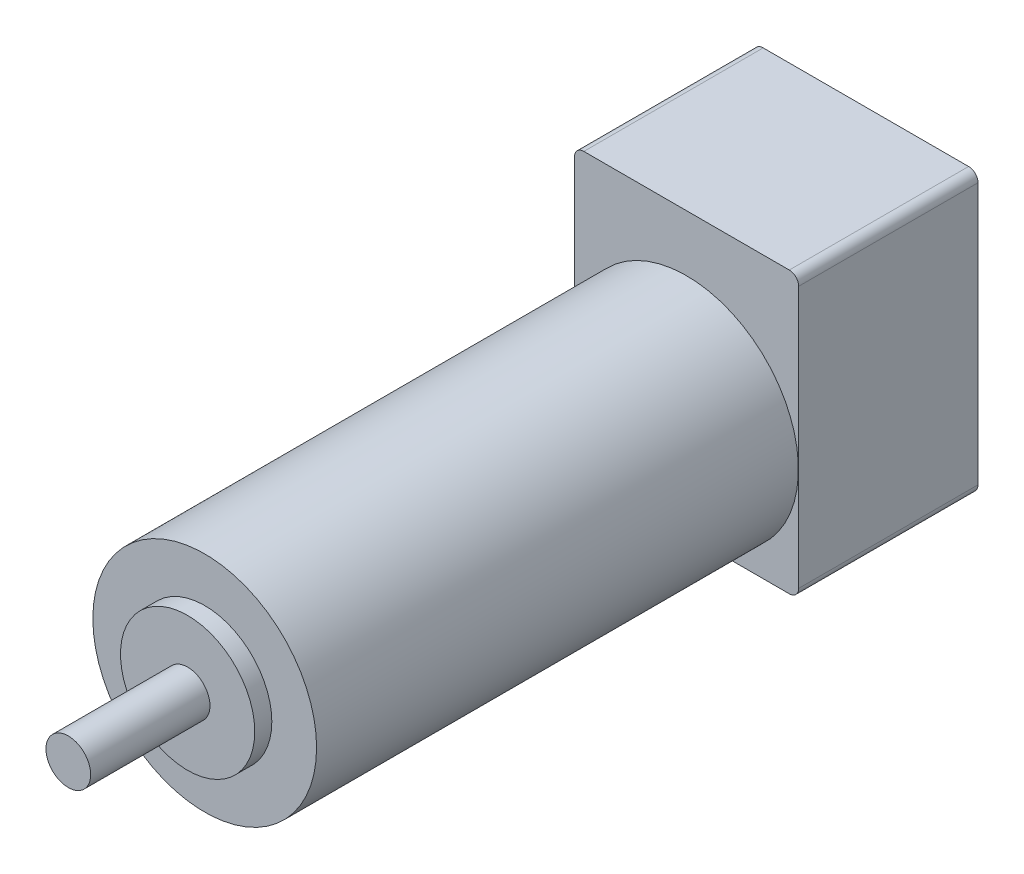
ISO-10303-21;
HEADER;
FILE_DESCRIPTION(('STEP AP214'),'2;1');
FILE_NAME('part.step','',(''),(''),'','','');
FILE_SCHEMA(('AUTOMOTIVE_DESIGN { 1 0 10303 214 1 1 1 1 }'));
ENDSEC;
DATA;
#1=APPLICATION_CONTEXT('core data for automotive mechanical design processes');
#2=APPLICATION_PROTOCOL_DEFINITION('international standard','automotive_design',2000,#1);
#3=PRODUCT_CONTEXT('',#1,'mechanical');
#4=PRODUCT('Part','Part','',(#3));
#5=PRODUCT_RELATED_PRODUCT_CATEGORY('part','',(#4));
#6=PRODUCT_DEFINITION_FORMATION('','',#4);
#7=PRODUCT_DEFINITION_CONTEXT('part definition',#1,'design');
#8=PRODUCT_DEFINITION('design','',#6,#7);
#9=PRODUCT_DEFINITION_SHAPE('','',#8);
#10=(LENGTH_UNIT() NAMED_UNIT(*) SI_UNIT(.MILLI.,.METRE.));
#11=(NAMED_UNIT(*) PLANE_ANGLE_UNIT() SI_UNIT($,.RADIAN.));
#12=(NAMED_UNIT(*) SI_UNIT($,.STERADIAN.) SOLID_ANGLE_UNIT());
#13=UNCERTAINTY_MEASURE_WITH_UNIT(LENGTH_MEASURE(1.E-05),#10,'distance_accuracy_value','');
#14=(GEOMETRIC_REPRESENTATION_CONTEXT(3) GLOBAL_UNCERTAINTY_ASSIGNED_CONTEXT((#13)) GLOBAL_UNIT_ASSIGNED_CONTEXT((#10,
#11,#12)) REPRESENTATION_CONTEXT('',''));
#15=CARTESIAN_POINT('',(0.,0.,0.));
#16=DIRECTION('',(0.,0.,1.));
#17=DIRECTION('',(1.,0.,0.));
#18=AXIS2_PLACEMENT_3D('',#15,#16,#17);
#19=CARTESIAN_POINT('',(-27.7622,-27.813,-48.4886));
#20=DIRECTION('',(0.,0.,1.));
#21=DIRECTION('',(1.,0.,0.));
#22=AXIS2_PLACEMENT_3D('',#19,#20,#21);
#23=CYLINDRICAL_SURFACE('',#22,2.54);
#24=DIRECTION('',(0.,0.,1.));
#25=VECTOR('',#24,1.);
#26=CARTESIAN_POINT('',(-30.3022,-27.813,-48.4886));
#27=LINE('',#26,#25);
#28=CARTESIAN_POINT('',(-30.3022,-27.813,-48.4886));
#29=VERTEX_POINT('',#28);
#30=CARTESIAN_POINT('',(-30.3022,-27.813,0.));
#31=VERTEX_POINT('',#30);
#32=EDGE_CURVE('E162',#29,#31,#27,.T.);
#33=ORIENTED_EDGE('',*,*,#32,.F.);
#34=CARTESIAN_POINT('',(-27.7622,-27.813,-48.4886));
#35=DIRECTION('',(0.,0.,-1.));
#36=DIRECTION('',(-1.,0.,0.));
#37=AXIS2_PLACEMENT_3D('',#34,#35,#36);
#38=CIRCLE('',#37,2.54);
#39=CARTESIAN_POINT('',(-27.7622,-30.353,-48.4886));
#40=VERTEX_POINT('',#39);
#41=EDGE_CURVE('E43',#40,#29,#38,.T.);
#42=ORIENTED_EDGE('',*,*,#41,.F.);
#43=DIRECTION('',(0.,0.,1.));
#44=VECTOR('',#43,1.);
#45=CARTESIAN_POINT('',(-27.7622,-30.353,-48.4886));
#46=LINE('',#45,#44);
#47=CARTESIAN_POINT('',(-27.7622,-30.353,0.));
#48=VERTEX_POINT('',#47);
#49=EDGE_CURVE('E165',#48,#40,#46,.F.);
#50=ORIENTED_EDGE('',*,*,#49,.F.);
#51=CARTESIAN_POINT('',(-27.7622,-27.813,0.));
#52=DIRECTION('',(0.,0.,-1.));
#53=DIRECTION('',(-1.,0.,0.));
#54=AXIS2_PLACEMENT_3D('',#51,#52,#53);
#55=CIRCLE('',#54,2.54);
#56=EDGE_CURVE('E11',#31,#48,#55,.F.);
#57=ORIENTED_EDGE('',*,*,#56,.F.);
#58=EDGE_LOOP('',(#33,#42,#50,#57));
#59=FACE_BOUND('',#58,.T.);
#60=ADVANCED_FACE('F36',(#59),#23,.T.);
#61=CARTESIAN_POINT('',(-27.7622,42.926,-48.4886));
#62=DIRECTION('',(0.,0.,1.));
#63=DIRECTION('',(1.,0.,0.));
#64=AXIS2_PLACEMENT_3D('',#61,#62,#63);
#65=CYLINDRICAL_SURFACE('',#64,2.54);
#66=DIRECTION('',(0.,0.,1.));
#67=VECTOR('',#66,1.);
#68=CARTESIAN_POINT('',(-27.7622,45.466,-48.4886));
#69=LINE('',#68,#67);
#70=CARTESIAN_POINT('',(-27.7622,45.466,-48.4886));
#71=VERTEX_POINT('',#70);
#72=CARTESIAN_POINT('',(-27.7622,45.466,0.));
#73=VERTEX_POINT('',#72);
#74=EDGE_CURVE('E151',#71,#73,#69,.T.);
#75=ORIENTED_EDGE('',*,*,#74,.F.);
#76=CARTESIAN_POINT('',(-27.7622,42.926,-48.4886));
#77=DIRECTION('',(0.,0.,-1.));
#78=DIRECTION('',(-1.,0.,0.));
#79=AXIS2_PLACEMENT_3D('',#76,#77,#78);
#80=CIRCLE('',#79,2.54);
#81=CARTESIAN_POINT('',(-30.3022,42.926,-48.4886));
#82=VERTEX_POINT('',#81);
#83=EDGE_CURVE('E157',#82,#71,#80,.T.);
#84=ORIENTED_EDGE('',*,*,#83,.F.);
#85=DIRECTION('',(0.,0.,1.));
#86=VECTOR('',#85,1.);
#87=CARTESIAN_POINT('',(-30.3022,42.926,-48.4886));
#88=LINE('',#87,#86);
#89=CARTESIAN_POINT('',(-30.3022,42.926,0.));
#90=VERTEX_POINT('',#89);
#91=EDGE_CURVE('E154',#90,#82,#88,.F.);
#92=ORIENTED_EDGE('',*,*,#91,.F.);
#93=CARTESIAN_POINT('',(-27.7622,42.926,0.));
#94=DIRECTION('',(0.,0.,-1.));
#95=DIRECTION('',(-1.,0.,0.));
#96=AXIS2_PLACEMENT_3D('',#93,#94,#95);
#97=CIRCLE('',#96,2.54);
#98=EDGE_CURVE('E159',#73,#90,#97,.F.);
#99=ORIENTED_EDGE('',*,*,#98,.F.);
#100=EDGE_LOOP('',(#75,#84,#92,#99));
#101=FACE_BOUND('',#100,.T.);
#102=ADVANCED_FACE('F176',(#101),#65,.T.);
#103=CARTESIAN_POINT('',(27.7876,42.926,-48.4886));
#104=DIRECTION('',(0.,0.,-1.));
#105=DIRECTION('',(-1.,0.,0.));
#106=AXIS2_PLACEMENT_3D('',#103,#104,#105);
#107=CYLINDRICAL_SURFACE('',#106,2.54);
#108=DIRECTION('',(0.,0.,-1.));
#109=VECTOR('',#108,1.);
#110=CARTESIAN_POINT('',(27.7876,45.466,-48.4886));
#111=LINE('',#110,#109);
#112=CARTESIAN_POINT('',(27.7876,45.466,0.));
#113=VERTEX_POINT('',#112);
#114=CARTESIAN_POINT('',(27.7876,45.466,-48.4886));
#115=VERTEX_POINT('',#114);
#116=EDGE_CURVE('E108',#113,#115,#111,.T.);
#117=ORIENTED_EDGE('',*,*,#116,.F.);
#118=CARTESIAN_POINT('',(27.7876,42.926,0.));
#119=DIRECTION('',(0.,0.,-1.));
#120=DIRECTION('',(-1.,0.,0.));
#121=AXIS2_PLACEMENT_3D('',#118,#119,#120);
#122=CIRCLE('',#121,2.54);
#123=CARTESIAN_POINT('',(30.3276,42.926,0.));
#124=VERTEX_POINT('',#123);
#125=EDGE_CURVE('E146',#124,#113,#122,.F.);
#126=ORIENTED_EDGE('',*,*,#125,.F.);
#127=DIRECTION('',(0.,0.,-1.));
#128=VECTOR('',#127,1.);
#129=CARTESIAN_POINT('',(30.3276,42.926,-48.4886));
#130=LINE('',#129,#128);
#131=CARTESIAN_POINT('',(30.3276,42.926,-48.4886));
#132=VERTEX_POINT('',#131);
#133=EDGE_CURVE('E143',#132,#124,#130,.F.);
#134=ORIENTED_EDGE('',*,*,#133,.F.);
#135=CARTESIAN_POINT('',(27.7876,42.926,-48.4886));
#136=DIRECTION('',(0.,0.,-1.));
#137=DIRECTION('',(-1.,0.,0.));
#138=AXIS2_PLACEMENT_3D('',#135,#136,#137);
#139=CIRCLE('',#138,2.54);
#140=EDGE_CURVE('E149',#115,#132,#139,.T.);
#141=ORIENTED_EDGE('',*,*,#140,.F.);
#142=EDGE_LOOP('',(#117,#126,#134,#141));
#143=FACE_BOUND('',#142,.T.);
#144=ADVANCED_FACE('F183',(#143),#107,.T.);
#145=CARTESIAN_POINT('',(27.7876,-27.813,-48.4886));
#146=DIRECTION('',(0.,0.,1.));
#147=DIRECTION('',(1.,0.,0.));
#148=AXIS2_PLACEMENT_3D('',#145,#146,#147);
#149=CYLINDRICAL_SURFACE('',#148,2.54);
#150=DIRECTION('',(0.,0.,1.));
#151=VECTOR('',#150,1.);
#152=CARTESIAN_POINT('',(27.7876,-30.353,-48.4886));
#153=LINE('',#152,#151);
#154=CARTESIAN_POINT('',(27.7876,-30.353,-48.4886));
#155=VERTEX_POINT('',#154);
#156=CARTESIAN_POINT('',(27.7876,-30.353,0.));
#157=VERTEX_POINT('',#156);
#158=EDGE_CURVE('E103',#155,#157,#153,.T.);
#159=ORIENTED_EDGE('',*,*,#158,.F.);
#160=CARTESIAN_POINT('',(27.7876,-27.813,-48.4886));
#161=DIRECTION('',(0.,0.,-1.));
#162=DIRECTION('',(-1.,0.,0.));
#163=AXIS2_PLACEMENT_3D('',#160,#161,#162);
#164=CIRCLE('',#163,2.54);
#165=CARTESIAN_POINT('',(30.3276,-27.813,-48.4886));
#166=VERTEX_POINT('',#165);
#167=EDGE_CURVE('E109',#166,#155,#164,.T.);
#168=ORIENTED_EDGE('',*,*,#167,.F.);
#169=DIRECTION('',(0.,0.,1.));
#170=VECTOR('',#169,1.);
#171=CARTESIAN_POINT('',(30.3276,-27.813,-48.4886));
#172=LINE('',#171,#170);
#173=CARTESIAN_POINT('',(30.3276,-27.813,0.));
#174=VERTEX_POINT('',#173);
#175=EDGE_CURVE('E106',#174,#166,#172,.F.);
#176=ORIENTED_EDGE('',*,*,#175,.F.);
#177=CARTESIAN_POINT('',(27.7876,-27.813,0.));
#178=DIRECTION('',(0.,0.,-1.));
#179=DIRECTION('',(-1.,0.,0.));
#180=AXIS2_PLACEMENT_3D('',#177,#178,#179);
#181=CIRCLE('',#180,2.54);
#182=EDGE_CURVE('E99',#157,#174,#181,.F.);
#183=ORIENTED_EDGE('',*,*,#182,.F.);
#184=EDGE_LOOP('',(#159,#168,#176,#183));
#185=FACE_BOUND('',#184,.T.);
#186=ADVANCED_FACE('F101',(#185),#149,.T.);
#187=CARTESIAN_POINT('',(0.,0.,134.8994));
#188=DIRECTION('',(0.,0.,1.));
#189=DIRECTION('',(1.,0.,0.));
#190=AXIS2_PLACEMENT_3D('',#187,#188,#189);
#191=PLANE('',#190);
#192=CARTESIAN_POINT('',(0.,0.,134.8994));
#193=DIRECTION('',(0.,0.,1.));
#194=DIRECTION('',(1.,0.,0.));
#195=AXIS2_PLACEMENT_3D('',#192,#193,#194);
#196=CIRCLE('',#195,18.1483);
#197=CARTESIAN_POINT('',(18.1483,0.,134.8994));
#198=VERTEX_POINT('',#197);
#199=EDGE_CURVE('E243',#198,#198,#196,.T.);
#200=ORIENTED_EDGE('',*,*,#199,.T.);
#201=EDGE_LOOP('',(#200));
#202=FACE_BOUND('',#201,.T.);
#203=CARTESIAN_POINT('',(0.,0.,134.8994));
#204=DIRECTION('',(0.,0.,1.));
#205=DIRECTION('',(1.,0.,0.));
#206=AXIS2_PLACEMENT_3D('',#203,#204,#205);
#207=CIRCLE('',#206,6.0452);
#208=CARTESIAN_POINT('',(6.0452,0.,134.8994));
#209=VERTEX_POINT('',#208);
#210=EDGE_CURVE('E252',#209,#209,#207,.T.);
#211=ORIENTED_EDGE('',*,*,#210,.F.);
#212=EDGE_LOOP('',(#211));
#213=FACE_BOUND('',#212,.T.);
#214=ADVANCED_FACE('F208',(#202,#213),#191,.T.);
#215=CARTESIAN_POINT('',(0.,0.,130.2766));
#216=DIRECTION('',(0.,0.,1.));
#217=DIRECTION('',(1.,0.,0.));
#218=AXIS2_PLACEMENT_3D('',#215,#216,#217);
#219=PLANE('',#218);
#220=CARTESIAN_POINT('',(0.,0.,130.2766));
#221=DIRECTION('',(0.,0.,1.));
#222=DIRECTION('',(1.,0.,0.));
#223=AXIS2_PLACEMENT_3D('',#220,#221,#222);
#224=CIRCLE('',#223,30.2514);
#225=CARTESIAN_POINT('',(30.2514,0.,130.2766));
#226=VERTEX_POINT('',#225);
#227=EDGE_CURVE('E117',#226,#226,#224,.T.);
#228=ORIENTED_EDGE('',*,*,#227,.T.);
#229=EDGE_LOOP('',(#228));
#230=FACE_BOUND('',#229,.T.);
#231=CARTESIAN_POINT('',(0.,0.,130.2766));
#232=DIRECTION('',(0.,0.,1.));
#233=DIRECTION('',(1.,0.,0.));
#234=AXIS2_PLACEMENT_3D('',#231,#232,#233);
#235=CIRCLE('',#234,18.1483);
#236=CARTESIAN_POINT('',(18.1483,0.,130.2766));
#237=VERTEX_POINT('',#236);
#238=EDGE_CURVE('E246',#237,#237,#235,.T.);
#239=ORIENTED_EDGE('',*,*,#238,.F.);
#240=EDGE_LOOP('',(#239));
#241=FACE_BOUND('',#240,.T.);
#242=ADVANCED_FACE('F212',(#230,#241),#219,.T.);
#243=CARTESIAN_POINT('',(0.,0.,130.2766));
#244=DIRECTION('',(0.,0.,-1.));
#245=DIRECTION('',(-1.,0.,0.));
#246=AXIS2_PLACEMENT_3D('',#243,#244,#245);
#247=CYLINDRICAL_SURFACE('',#246,30.2514);
#248=ORIENTED_EDGE('',*,*,#227,.F.);
#249=EDGE_LOOP('',(#248));
#250=FACE_BOUND('',#249,.T.);
#251=CARTESIAN_POINT('',(0.,0.,0.));
#252=DIRECTION('',(0.,0.,-1.));
#253=DIRECTION('',(-1.,0.,0.));
#254=AXIS2_PLACEMENT_3D('',#251,#252,#253);
#255=CIRCLE('',#254,30.2514);
#256=CARTESIAN_POINT('',(-30.2514,0.,0.));
#257=VERTEX_POINT('',#256);
#258=EDGE_CURVE('E134',#257,#257,#255,.T.);
#259=ORIENTED_EDGE('',*,*,#258,.F.);
#260=EDGE_LOOP('',(#259));
#261=FACE_BOUND('',#260,.T.);
#262=ADVANCED_FACE('F209',(#250,#261),#247,.T.);
#263=CARTESIAN_POINT('',(-30.3022,45.466,0.));
#264=DIRECTION('',(0.,0.,-1.));
#265=DIRECTION('',(-1.,0.,0.));
#266=AXIS2_PLACEMENT_3D('',#263,#264,#265);
#267=PLANE('',#266);
#268=DIRECTION('',(0.,1.,0.));
#269=VECTOR('',#268,1.);
#270=CARTESIAN_POINT('',(-30.3022,-30.353,0.));
#271=LINE('',#270,#269);
#272=EDGE_CURVE('E173',#31,#90,#271,.T.);
#273=ORIENTED_EDGE('',*,*,#272,.F.);
#274=ORIENTED_EDGE('',*,*,#56,.T.);
#275=DIRECTION('',(-1.,0.,0.));
#276=VECTOR('',#275,1.);
#277=CARTESIAN_POINT('',(-30.3022,-30.353,0.));
#278=LINE('',#277,#276);
#279=EDGE_CURVE('E114',#157,#48,#278,.T.);
#280=ORIENTED_EDGE('',*,*,#279,.F.);
#281=ORIENTED_EDGE('',*,*,#182,.T.);
#282=DIRECTION('',(0.,-1.,0.));
#283=VECTOR('',#282,1.);
#284=CARTESIAN_POINT('',(30.3276,-30.353,0.));
#285=LINE('',#284,#283);
#286=EDGE_CURVE('E122',#124,#174,#285,.T.);
#287=ORIENTED_EDGE('',*,*,#286,.F.);
#288=ORIENTED_EDGE('',*,*,#125,.T.);
#289=DIRECTION('',(1.,0.,0.));
#290=VECTOR('',#289,1.);
#291=CARTESIAN_POINT('',(-30.3022,45.466,0.));
#292=LINE('',#291,#290);
#293=EDGE_CURVE('E126',#73,#113,#292,.T.);
#294=ORIENTED_EDGE('',*,*,#293,.F.);
#295=ORIENTED_EDGE('',*,*,#98,.T.);
#296=EDGE_LOOP('',(#273,#274,#280,#281,#287,#288,#294,#295));
#297=FACE_BOUND('',#296,.T.);
#298=ORIENTED_EDGE('',*,*,#258,.T.);
#299=EDGE_LOOP('',(#298));
#300=FACE_BOUND('',#299,.T.);
#301=ADVANCED_FACE('F119',(#297,#300),#267,.F.);
#302=CARTESIAN_POINT('',(-30.3022,-30.353,-48.4886));
#303=DIRECTION('',(1.,0.,0.));
#304=DIRECTION('',(0.,0.,-1.));
#305=AXIS2_PLACEMENT_3D('',#302,#303,#304);
#306=PLANE('',#305);
#307=DIRECTION('',(0.,1.,0.));
#308=VECTOR('',#307,1.);
#309=CARTESIAN_POINT('',(-30.3022,-30.353,-48.4886));
#310=LINE('',#309,#308);
#311=EDGE_CURVE('E121',#29,#82,#310,.T.);
#312=ORIENTED_EDGE('',*,*,#311,.F.);
#313=ORIENTED_EDGE('',*,*,#32,.T.);
#314=ORIENTED_EDGE('',*,*,#272,.T.);
#315=ORIENTED_EDGE('',*,*,#91,.T.);
#316=EDGE_LOOP('',(#312,#313,#314,#315));
#317=FACE_BOUND('',#316,.T.);
#318=ADVANCED_FACE('F171',(#317),#306,.F.);
#319=CARTESIAN_POINT('',(-30.3022,45.466,-48.4886));
#320=DIRECTION('',(0.,-1.,0.));
#321=DIRECTION('',(1.,0.,0.));
#322=AXIS2_PLACEMENT_3D('',#319,#320,#321);
#323=PLANE('',#322);
#324=DIRECTION('',(1.,0.,0.));
#325=VECTOR('',#324,1.);
#326=CARTESIAN_POINT('',(-30.3022,45.466,-48.4886));
#327=LINE('',#326,#325);
#328=EDGE_CURVE('E124',#71,#115,#327,.T.);
#329=ORIENTED_EDGE('',*,*,#328,.F.);
#330=ORIENTED_EDGE('',*,*,#74,.T.);
#331=ORIENTED_EDGE('',*,*,#293,.T.);
#332=ORIENTED_EDGE('',*,*,#116,.T.);
#333=EDGE_LOOP('',(#329,#330,#331,#332));
#334=FACE_BOUND('',#333,.T.);
#335=ADVANCED_FACE('F185',(#334),#323,.F.);
#336=CARTESIAN_POINT('',(30.3276,-30.353,-48.4886));
#337=DIRECTION('',(-1.,0.,0.));
#338=DIRECTION('',(0.,-1.,0.));
#339=AXIS2_PLACEMENT_3D('',#336,#337,#338);
#340=PLANE('',#339);
#341=DIRECTION('',(0.,-1.,0.));
#342=VECTOR('',#341,1.);
#343=CARTESIAN_POINT('',(30.3276,-30.353,-48.4886));
#344=LINE('',#343,#342);
#345=EDGE_CURVE('E131',#132,#166,#344,.T.);
#346=ORIENTED_EDGE('',*,*,#345,.F.);
#347=ORIENTED_EDGE('',*,*,#133,.T.);
#348=ORIENTED_EDGE('',*,*,#286,.T.);
#349=ORIENTED_EDGE('',*,*,#175,.T.);
#350=EDGE_LOOP('',(#346,#347,#348,#349));
#351=FACE_BOUND('',#350,.T.);
#352=ADVANCED_FACE('F188',(#351),#340,.F.);
#353=CARTESIAN_POINT('',(-30.3022,-30.353,-48.4886));
#354=DIRECTION('',(0.,1.,0.));
#355=DIRECTION('',(-1.,0.,0.));
#356=AXIS2_PLACEMENT_3D('',#353,#354,#355);
#357=PLANE('',#356);
#358=ORIENTED_EDGE('',*,*,#279,.T.);
#359=ORIENTED_EDGE('',*,*,#49,.T.);
#360=DIRECTION('',(-1.,0.,0.));
#361=VECTOR('',#360,1.);
#362=CARTESIAN_POINT('',(-30.3022,-30.353,-48.4886));
#363=LINE('',#362,#361);
#364=EDGE_CURVE('E116',#155,#40,#363,.T.);
#365=ORIENTED_EDGE('',*,*,#364,.F.);
#366=ORIENTED_EDGE('',*,*,#158,.T.);
#367=EDGE_LOOP('',(#358,#359,#365,#366));
#368=FACE_BOUND('',#367,.T.);
#369=ADVANCED_FACE('F113',(#368),#357,.F.);
#370=CARTESIAN_POINT('',(-30.3022,45.466,-48.4886));
#371=DIRECTION('',(0.,0.,-1.));
#372=DIRECTION('',(-1.,0.,0.));
#373=AXIS2_PLACEMENT_3D('',#370,#371,#372);
#374=PLANE('',#373);
#375=ORIENTED_EDGE('',*,*,#364,.T.);
#376=ORIENTED_EDGE('',*,*,#41,.T.);
#377=ORIENTED_EDGE('',*,*,#311,.T.);
#378=ORIENTED_EDGE('',*,*,#83,.T.);
#379=ORIENTED_EDGE('',*,*,#328,.T.);
#380=ORIENTED_EDGE('',*,*,#140,.T.);
#381=ORIENTED_EDGE('',*,*,#345,.T.);
#382=ORIENTED_EDGE('',*,*,#167,.T.);
#383=EDGE_LOOP('',(#375,#376,#377,#378,#379,#380,#381,#382));
#384=FACE_BOUND('',#383,.T.);
#385=ADVANCED_FACE('F167',(#384),#374,.T.);
#386=CARTESIAN_POINT('',(0.,0.,134.8994));
#387=DIRECTION('',(0.,0.,-1.));
#388=DIRECTION('',(-1.,0.,0.));
#389=AXIS2_PLACEMENT_3D('',#386,#387,#388);
#390=CYLINDRICAL_SURFACE('',#389,18.1483);
#391=ORIENTED_EDGE('',*,*,#199,.F.);
#392=EDGE_LOOP('',(#391));
#393=FACE_BOUND('',#392,.T.);
#394=ORIENTED_EDGE('',*,*,#238,.T.);
#395=EDGE_LOOP('',(#394));
#396=FACE_BOUND('',#395,.T.);
#397=ADVANCED_FACE('F226',(#393,#396),#390,.T.);
#398=CARTESIAN_POINT('',(0.,0.,167.1574));
#399=DIRECTION('',(0.,0.,-1.));
#400=DIRECTION('',(-1.,0.,0.));
#401=AXIS2_PLACEMENT_3D('',#398,#399,#400);
#402=CYLINDRICAL_SURFACE('',#401,6.0452);
#403=CARTESIAN_POINT('',(0.,0.,167.1574));
#404=DIRECTION('',(0.,0.,1.));
#405=DIRECTION('',(1.,0.,0.));
#406=AXIS2_PLACEMENT_3D('',#403,#404,#405);
#407=CIRCLE('',#406,6.0452);
#408=CARTESIAN_POINT('',(6.0452,0.,167.1574));
#409=VERTEX_POINT('',#408);
#410=EDGE_CURVE('E248',#409,#409,#407,.T.);
#411=ORIENTED_EDGE('',*,*,#410,.F.);
#412=EDGE_LOOP('',(#411));
#413=FACE_BOUND('',#412,.T.);
#414=ORIENTED_EDGE('',*,*,#210,.T.);
#415=EDGE_LOOP('',(#414));
#416=FACE_BOUND('',#415,.T.);
#417=ADVANCED_FACE('F232',(#413,#416),#402,.T.);
#418=CARTESIAN_POINT('',(0.,0.,167.1574));
#419=DIRECTION('',(0.,0.,1.));
#420=DIRECTION('',(1.,0.,0.));
#421=AXIS2_PLACEMENT_3D('',#418,#419,#420);
#422=PLANE('',#421);
#423=ORIENTED_EDGE('',*,*,#410,.T.);
#424=EDGE_LOOP('',(#423));
#425=FACE_BOUND('',#424,.T.);
#426=ADVANCED_FACE('F237',(#425),#422,.T.);
#427=CLOSED_SHELL('',(#60,#102,#144,#186,#214,#242,#262,#301,#318,#335,#352,#369,#385,#397,#417,#426));
#428=MANIFOLD_SOLID_BREP('B2',#427);
#429=ADVANCED_BREP_SHAPE_REPRESENTATION('',(#18,#428),#14);
#430=SHAPE_DEFINITION_REPRESENTATION(#9,#429);
ENDSEC;
END-ISO-10303-21;
